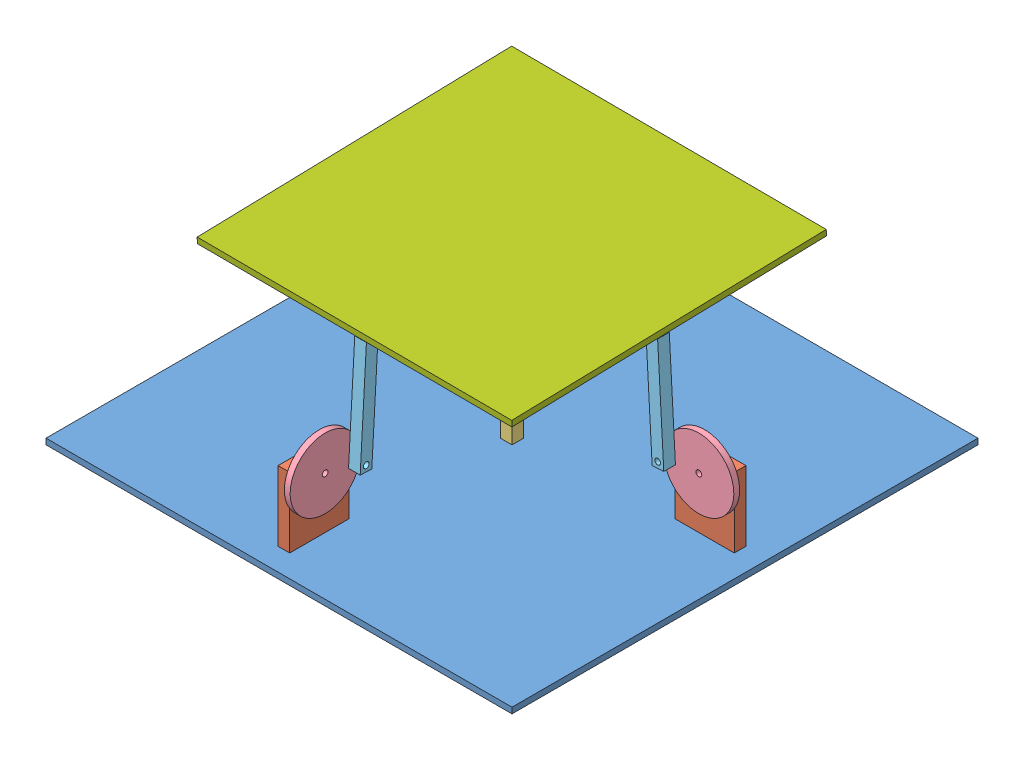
SolidWorks assembly AssemblyF.SLDASM, configuration Default (file format 12000). Lengths in mm.
Overall size (400 412.84 488.58).
12 component instances, 8 part files, 23 mates.
Components (placement in the parent):
- Floor-1: Floor.SLDPRT [Default] at (-13.99 219.6122 478.5841) size (400 5 400)
- Base-1: Base.SLDPRT [Default] at (316.01 224.6122 258.5841) size (50.8 60 10)
- Support-1: Support.SLDPRT [Default] at (181.01 224.6122 283.5841) size (10 141 10)
- Disk-1: Disk.SLDPRT [Default] at (341.41 273.6122 268.5841) x (-0.999149 0.041238 0) z (0 0 1) size (60 60 5)
- Lever Arm-1: Lever Arm.SLDPRT [Default] at (311.3151 269.3914 283.5841) x (0.998477 0.055172 0) z (0 0 1) size (10 96 10)
- Lever Arm-2: Lever Arm.SLDPRT [Default] at (191.01 267.2987 413.9059) x (0 -0.055819 -0.998441) z (1 0 0) size (10 96 10)
- Joint-2: Joint.SLDPRT [Default] at (311.011 365.521 278.5841) x (-0.183304 -0.024631 0.982748) z (-0.983045 0.009402 -0.183124) size (10 11 10)
- plate-1: plate.SLDPRT [Default] at (321.0604 372.9685 413.823) x (-0.999989 0.004728 0.000104) z (-0.000019 -0.025937 0.999664) size (270 5 270)
- Base-2: Base.SLDPRT [Default] at (176.01 224.6122 408.5841) x (0 0 1) z (-1 0 0) size (50.8 60 10)
- Disk-2: Disk.SLDPRT [Default] at (176.01 273.6122 433.9841) x (0 -0.063007 -0.998013) z (1 0 0) size (60 60 5)
- Joint-3: Joint.SLDPRT [Default] at (186.01 362.87 403.555) x (0.902091 0.006928 -0.431491) z (0.431521 -0.025438 0.901744) size (10 11 10)
- JointS-1: JointS.SLDPRT [Default] at (186.01 365.6122 278.5841) x (0.969516 -0.010938 0.244784) z (-0.244983 -0.023988 0.969231) size (10 11.5 10)
Mates (geometry in assembly coordinates):
- Coincident1: coincident anti-aligned: plane of Floor-1 through (-13.99 224.6122 478.5841) normal (0 1 0); plane of Support-1 through (181.01 224.6122 283.5841) normal (0 -1 0)
- Distance2: distance = 195 mm aligned: plane of Support-1 through (181.01 365.6122 283.5841) normal (0 0 1); plane of Floor-1 through (-13.99 224.6122 478.5841) normal (0 0 1)
- Distance3: distance = 195 mm aligned: plane of Floor-1 through (-13.99 224.6122 478.5841) normal (-1 0 0); plane of Support-1 through (181.01 365.6122 283.5841) normal (-1 0 0)
- Distance5: distance = 5 mm anti-aligned: plane of Support-1 through (181.01 365.6122 273.5841) normal (0 0 -1); plane of Base-1 through (316.01 224.6122 268.5841) normal (0 0 1)
- Coincident7: coincident anti-aligned: plane of Floor-1 through (-13.99 224.6122 478.5841) normal (0 1 0); plane of Base-1 through (316.01 224.6122 268.5841) normal (0 -1 0)
- Coincident14: coincident anti-aligned: plane of Floor-1 through (-13.99 224.6122 478.5841) normal (0 1 0); plane of Base-2 through (166.01 224.6122 408.5841) normal (0 -1 0)
- Distance7: distance = 5 mm anti-aligned: plane of Base-2 through (176.01 224.6122 408.5841) normal (1 0 0); plane of Support-1 through (181.01 365.6122 283.5841) normal (-1 0 0)
- Concentric12: concentric aligned: cylinder of Base-1 through (341.41 273.6122 268.5841) axis (0 0 -1) radius 2.5; cylinder of Disk-1 through (341.41 273.6122 273.5841) axis (0 0 -1) radius 2.5
- Coincident27: coincident anti-aligned: plane of Base-1 through (316.01 224.6122 268.5841) normal (0 0 1); plane of Disk-1 through (341.41 273.6122 268.5841) normal (0 0 -1)
- Concentric13: concentric anti-aligned: cylinder of Disk-1 through (316.0316 274.6597 273.5841) axis (0 0 -1) radius 2.5; cylinder of Lever Arm-1 through (316.0316 274.6597 272.5841) axis (0 0 1) radius 2.5
- Coincident28: coincident anti-aligned: plane of Disk-1 through (341.41 273.6122 273.5841) normal (0 0 1); plane of Lever Arm-1 through (306.0186 365.2452 273.5841) normal (0 0 -1)
- Tangent9: tangent aligned: sphere of Lever Arm-1; sphere of Joint-2
- Coincident29: coincident anti-aligned: plane of Base-2 through (176.01 224.6122 408.5841) normal (1 0 0); plane of Disk-2 through (176.01 273.6122 433.9841) normal (-1 0 0)
- Concentric15: concentric anti-aligned: cylinder of Base-2 through (166.01 273.6122 433.9841) axis (1 0 0) radius 2.5; cylinder of Disk-2 through (181.01 273.6122 433.9841) axis (-1 0 0) radius 2.5
- Concentric16: concentric anti-aligned: cylinder of Lever Arm-2 through (180.01 272.0118 408.6346) axis (1 0 0) radius 2.5; cylinder of Disk-2 through (181.01 272.0118 408.6346) axis (-1 0 0) radius 2.5
- Coincident30: coincident anti-aligned: plane of Lever Arm-2 through (181.01 363.149 408.5473) normal (-1 0 0); plane of Disk-2 through (181.01 273.6122 433.9841) normal (1 0 0)
- Tangent8: tangent aligned: sphere of Lever Arm-2; sphere of Joint-3
- Distance8: distance = 125 mm anti-aligned: plane of Support-1 through (181.01 365.6122 283.5841) normal (0 0 1); plane of Base-2 through (166.01 224.6122 408.5841) normal (0 0 -1)
- Distance9: distance = 125 mm anti-aligned: plane of Support-1 through (191.01 365.6122 283.5841) normal (1 0 0); plane of Base-1 through (316.01 224.6122 268.5841) normal (-1 0 0)
- Coincident44: coincident aligned: circle of plate-1; circle of Joint-3
- Coincident45: coincident aligned: circle of Joint-2; circle of plate-1
- Tangent10: tangent aligned: sphere of Support-1; sphere of JointS-1
- Coincident46: coincident aligned: circle of plate-1; circle of JointS-1
